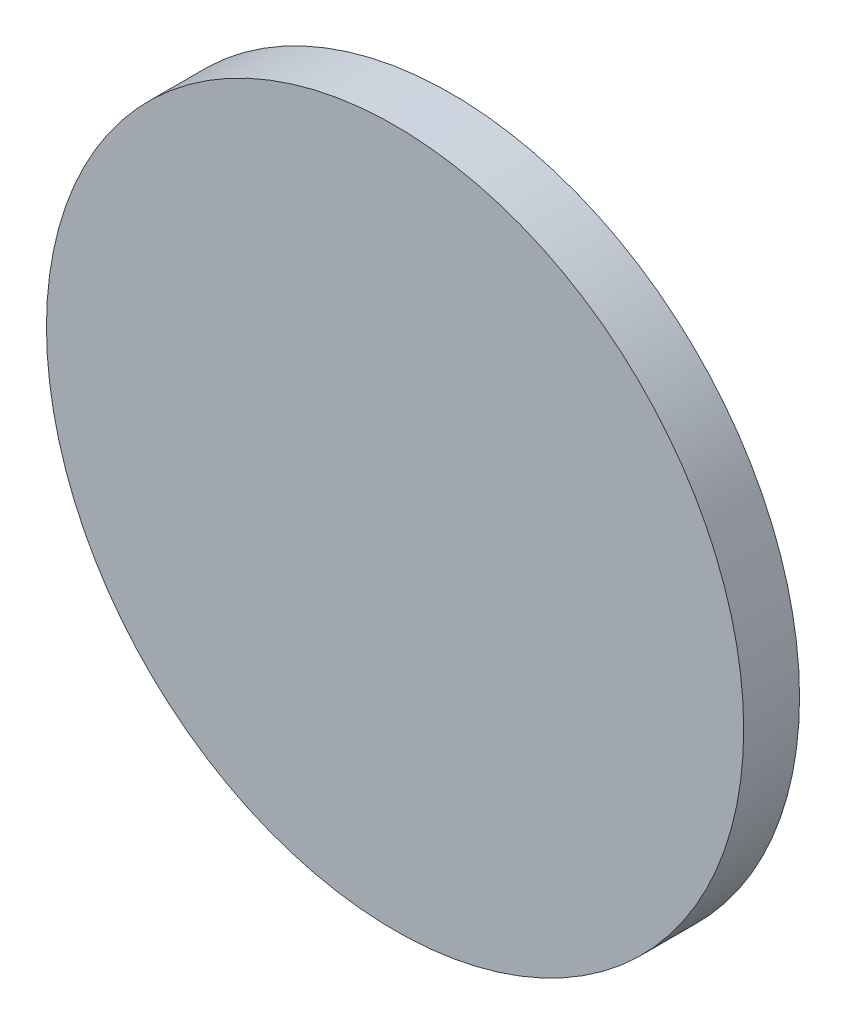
ISO-10303-21;
HEADER;
FILE_DESCRIPTION(('STEP AP214'),'2;1');
FILE_NAME('part.step','',(''),(''),'','','');
FILE_SCHEMA(('AUTOMOTIVE_DESIGN { 1 0 10303 214 1 1 1 1 }'));
ENDSEC;
DATA;
#1=APPLICATION_CONTEXT('core data for automotive mechanical design processes');
#2=APPLICATION_PROTOCOL_DEFINITION('international standard','automotive_design',2000,#1);
#3=PRODUCT_CONTEXT('',#1,'mechanical');
#4=PRODUCT('Part','Part','',(#3));
#5=PRODUCT_RELATED_PRODUCT_CATEGORY('part','',(#4));
#6=PRODUCT_DEFINITION_FORMATION('','',#4);
#7=PRODUCT_DEFINITION_CONTEXT('part definition',#1,'design');
#8=PRODUCT_DEFINITION('design','',#6,#7);
#9=PRODUCT_DEFINITION_SHAPE('','',#8);
#10=(LENGTH_UNIT() NAMED_UNIT(*) SI_UNIT(.MILLI.,.METRE.));
#11=(NAMED_UNIT(*) PLANE_ANGLE_UNIT() SI_UNIT($,.RADIAN.));
#12=(NAMED_UNIT(*) SI_UNIT($,.STERADIAN.) SOLID_ANGLE_UNIT());
#13=UNCERTAINTY_MEASURE_WITH_UNIT(LENGTH_MEASURE(1.E-05),#10,'distance_accuracy_value','');
#14=(GEOMETRIC_REPRESENTATION_CONTEXT(3) GLOBAL_UNCERTAINTY_ASSIGNED_CONTEXT((#13)) GLOBAL_UNIT_ASSIGNED_CONTEXT((#10,
#11,#12)) REPRESENTATION_CONTEXT('',''));
#15=CARTESIAN_POINT('',(0.,0.,0.));
#16=DIRECTION('',(0.,0.,1.));
#17=DIRECTION('',(1.,0.,0.));
#18=AXIS2_PLACEMENT_3D('',#15,#16,#17);
#19=CARTESIAN_POINT('',(0.,0.,1.8666666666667));
#20=DIRECTION('',(0.,0.,-1.));
#21=DIRECTION('',(-1.,0.,0.));
#22=AXIS2_PLACEMENT_3D('',#19,#20,#21);
#23=PLANE('',#22);
#24=CARTESIAN_POINT('',(0.,0.,1.8666666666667));
#25=DIRECTION('',(0.,0.,-1.));
#26=DIRECTION('',(-1.,0.,0.));
#27=AXIS2_PLACEMENT_3D('',#24,#25,#26);
#28=CIRCLE('',#27,15.849056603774);
#29=CARTESIAN_POINT('',(-15.849056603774,0.,1.8666666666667));
#30=VERTEX_POINT('',#29);
#31=EDGE_CURVE('E8',#30,#30,#28,.T.);
#32=ORIENTED_EDGE('',*,*,#31,.T.);
#33=EDGE_LOOP('',(#32));
#34=FACE_BOUND('',#33,.T.);
#35=ADVANCED_FACE('F12',(#34),#23,.T.);
#36=CARTESIAN_POINT('',(0.,0.,2.6666666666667));
#37=DIRECTION('',(0.,0.,-1.));
#38=DIRECTION('',(-1.,0.,0.));
#39=AXIS2_PLACEMENT_3D('',#36,#37,#38);
#40=CYLINDRICAL_SURFACE('',#39,15.849056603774);
#41=CARTESIAN_POINT('',(0.,0.,0.));
#42=DIRECTION('',(0.,0.,-1.));
#43=DIRECTION('',(-1.,0.,0.));
#44=AXIS2_PLACEMENT_3D('',#41,#42,#43);
#45=CIRCLE('',#44,15.849056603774);
#46=CARTESIAN_POINT('',(-15.849056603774,0.,0.));
#47=VERTEX_POINT('',#46);
#48=EDGE_CURVE('E18',#47,#47,#45,.T.);
#49=ORIENTED_EDGE('',*,*,#48,.T.);
#50=EDGE_LOOP('',(#49));
#51=FACE_BOUND('',#50,.T.);
#52=ORIENTED_EDGE('',*,*,#31,.F.);
#53=EDGE_LOOP('',(#52));
#54=FACE_BOUND('',#53,.T.);
#55=ADVANCED_FACE('F45',(#51,#54),#40,.F.);
#56=CARTESIAN_POINT('',(0.,15.849056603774,0.));
#57=DIRECTION('',(0.,0.,-1.));
#58=DIRECTION('',(-1.,0.,0.));
#59=AXIS2_PLACEMENT_3D('',#56,#57,#58);
#60=PLANE('',#59);
#61=CARTESIAN_POINT('',(0.,0.,0.));
#62=DIRECTION('',(0.,0.,-1.));
#63=DIRECTION('',(-1.,0.,0.));
#64=AXIS2_PLACEMENT_3D('',#61,#62,#63);
#65=CIRCLE('',#64,16.649056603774);
#66=CARTESIAN_POINT('',(-16.649056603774,0.,0.));
#67=VERTEX_POINT('',#66);
#68=EDGE_CURVE('E22',#67,#67,#65,.T.);
#69=ORIENTED_EDGE('',*,*,#68,.T.);
#70=EDGE_LOOP('',(#69));
#71=FACE_BOUND('',#70,.T.);
#72=ORIENTED_EDGE('',*,*,#48,.F.);
#73=EDGE_LOOP('',(#72));
#74=FACE_BOUND('',#73,.T.);
#75=ADVANCED_FACE('F42',(#71,#74),#60,.T.);
#76=CARTESIAN_POINT('',(0.,0.,2.6666666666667));
#77=DIRECTION('',(0.,0.,-1.));
#78=DIRECTION('',(-1.,0.,0.));
#79=AXIS2_PLACEMENT_3D('',#76,#77,#78);
#80=CYLINDRICAL_SURFACE('',#79,16.649056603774);
#81=CARTESIAN_POINT('',(0.,0.,2.6666666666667));
#82=DIRECTION('',(0.,0.,-1.));
#83=DIRECTION('',(-1.,0.,0.));
#84=AXIS2_PLACEMENT_3D('',#81,#82,#83);
#85=CIRCLE('',#84,16.649056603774);
#86=CARTESIAN_POINT('',(-16.649056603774,0.,2.6666666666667));
#87=VERTEX_POINT('',#86);
#88=EDGE_CURVE('E26',#87,#87,#85,.T.);
#89=ORIENTED_EDGE('',*,*,#88,.T.);
#90=EDGE_LOOP('',(#89));
#91=FACE_BOUND('',#90,.T.);
#92=ORIENTED_EDGE('',*,*,#68,.F.);
#93=EDGE_LOOP('',(#92));
#94=FACE_BOUND('',#93,.T.);
#95=ADVANCED_FACE('F32',(#91,#94),#80,.T.);
#96=CARTESIAN_POINT('',(0.,16.649056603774,2.6666666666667));
#97=DIRECTION('',(0.,0.,1.));
#98=DIRECTION('',(1.,0.,0.));
#99=AXIS2_PLACEMENT_3D('',#96,#97,#98);
#100=PLANE('',#99);
#101=ORIENTED_EDGE('',*,*,#88,.F.);
#102=EDGE_LOOP('',(#101));
#103=FACE_BOUND('',#102,.T.);
#104=ADVANCED_FACE('F35',(#103),#100,.T.);
#105=CLOSED_SHELL('',(#35,#55,#75,#95,#104));
#106=MANIFOLD_SOLID_BREP('B1',#105);
#107=ADVANCED_BREP_SHAPE_REPRESENTATION('',(#18,#106),#14);
#108=SHAPE_DEFINITION_REPRESENTATION(#9,#107);
ENDSEC;
END-ISO-10303-21;
